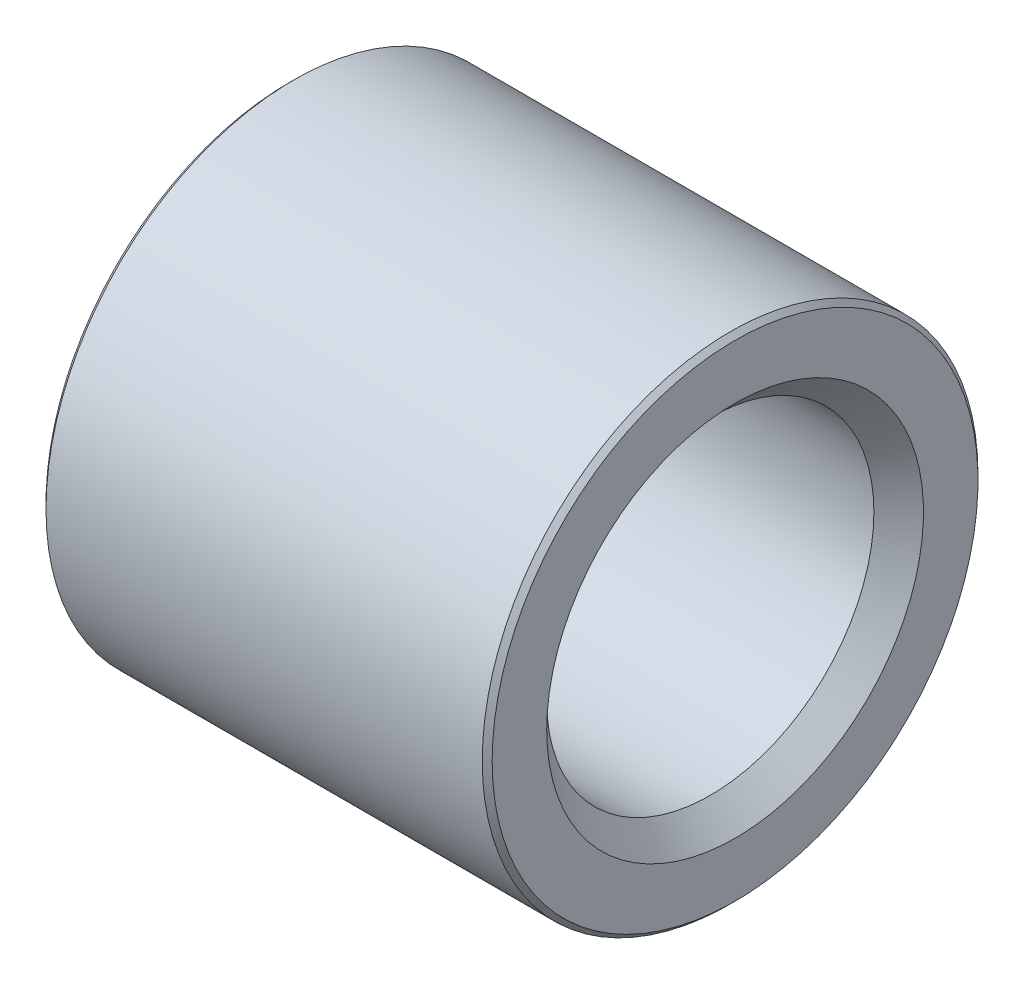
ISO-10303-21;
HEADER;
FILE_DESCRIPTION(('STEP AP214'),'2;1');
FILE_NAME('part.step','',(''),(''),'','','');
FILE_SCHEMA(('AUTOMOTIVE_DESIGN { 1 0 10303 214 1 1 1 1 }'));
ENDSEC;
DATA;
#1=APPLICATION_CONTEXT('core data for automotive mechanical design processes');
#2=APPLICATION_PROTOCOL_DEFINITION('international standard','automotive_design',2000,#1);
#3=PRODUCT_CONTEXT('',#1,'mechanical');
#4=PRODUCT('Part','Part','',(#3));
#5=PRODUCT_RELATED_PRODUCT_CATEGORY('part','',(#4));
#6=PRODUCT_DEFINITION_FORMATION('','',#4);
#7=PRODUCT_DEFINITION_CONTEXT('part definition',#1,'design');
#8=PRODUCT_DEFINITION('design','',#6,#7);
#9=PRODUCT_DEFINITION_SHAPE('','',#8);
#10=(LENGTH_UNIT() NAMED_UNIT(*) SI_UNIT(.MILLI.,.METRE.));
#11=(NAMED_UNIT(*) PLANE_ANGLE_UNIT() SI_UNIT($,.RADIAN.));
#12=(NAMED_UNIT(*) SI_UNIT($,.STERADIAN.) SOLID_ANGLE_UNIT());
#13=UNCERTAINTY_MEASURE_WITH_UNIT(LENGTH_MEASURE(1.E-05),#10,'distance_accuracy_value','');
#14=(GEOMETRIC_REPRESENTATION_CONTEXT(3) GLOBAL_UNCERTAINTY_ASSIGNED_CONTEXT((#13)) GLOBAL_UNIT_ASSIGNED_CONTEXT((#10,
#11,#12)) REPRESENTATION_CONTEXT('',''));
#15=CARTESIAN_POINT('',(0.,0.,0.));
#16=DIRECTION('',(0.,0.,1.));
#17=DIRECTION('',(1.,0.,0.));
#18=AXIS2_PLACEMENT_3D('',#15,#16,#17);
#19=CARTESIAN_POINT('',(45.,19.,0.));
#20=DIRECTION('',(-1.,0.,0.));
#21=DIRECTION('',(0.,0.,1.));
#22=AXIS2_PLACEMENT_3D('',#19,#20,#21);
#23=PLANE('',#22);
#24=CARTESIAN_POINT('',(45.,0.,0.));
#25=DIRECTION('',(-1.,0.,0.));
#26=DIRECTION('',(0.,0.,1.));
#27=AXIS2_PLACEMENT_3D('',#24,#25,#26);
#28=CIRCLE('',#27,24.5);
#29=CARTESIAN_POINT('',(45.,0.,24.5));
#30=VERTEX_POINT('',#29);
#31=EDGE_CURVE('E42',#30,#30,#28,.F.);
#32=ORIENTED_EDGE('',*,*,#31,.T.);
#33=EDGE_LOOP('',(#32));
#34=FACE_BOUND('',#33,.T.);
#35=CARTESIAN_POINT('',(45.,0.,0.));
#36=DIRECTION('',(-1.,0.,0.));
#37=DIRECTION('',(0.,0.,1.));
#38=AXIS2_PLACEMENT_3D('',#35,#36,#37);
#39=CIRCLE('',#38,19.);
#40=CARTESIAN_POINT('',(45.,0.,19.));
#41=VERTEX_POINT('',#40);
#42=EDGE_CURVE('E55',#41,#41,#39,.T.);
#43=ORIENTED_EDGE('',*,*,#42,.T.);
#44=EDGE_LOOP('',(#43));
#45=FACE_BOUND('',#44,.T.);
#46=ADVANCED_FACE('F35',(#34,#45),#23,.F.);
#47=CARTESIAN_POINT('',(42.5,0.,0.));
#48=DIRECTION('',(1.,0.,0.));
#49=DIRECTION('',(0.,0.,-1.));
#50=AXIS2_PLACEMENT_3D('',#47,#48,#49);
#51=CONICAL_SURFACE('',#50,16.5,0.785398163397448);
#52=ORIENTED_EDGE('',*,*,#42,.F.);
#53=EDGE_LOOP('',(#52));
#54=FACE_BOUND('',#53,.T.);
#55=CARTESIAN_POINT('',(42.5,0.,0.));
#56=DIRECTION('',(-1.,0.,0.));
#57=DIRECTION('',(0.,0.,1.));
#58=AXIS2_PLACEMENT_3D('',#55,#56,#57);
#59=CIRCLE('',#58,16.5);
#60=CARTESIAN_POINT('',(42.5,0.,16.5));
#61=VERTEX_POINT('',#60);
#62=EDGE_CURVE('E58',#61,#61,#59,.T.);
#63=ORIENTED_EDGE('',*,*,#62,.T.);
#64=EDGE_LOOP('',(#63));
#65=FACE_BOUND('',#64,.T.);
#66=ADVANCED_FACE('F85',(#54,#65),#51,.F.);
#67=CARTESIAN_POINT('',(0.,0.,0.));
#68=DIRECTION('',(-1.,0.,0.));
#69=DIRECTION('',(0.,0.,1.));
#70=AXIS2_PLACEMENT_3D('',#67,#68,#69);
#71=CYLINDRICAL_SURFACE('',#70,16.5);
#72=ORIENTED_EDGE('',*,*,#62,.F.);
#73=EDGE_LOOP('',(#72));
#74=FACE_BOUND('',#73,.T.);
#75=CARTESIAN_POINT('',(2.5,0.,0.));
#76=DIRECTION('',(-1.,0.,0.));
#77=DIRECTION('',(0.,0.,1.));
#78=AXIS2_PLACEMENT_3D('',#75,#76,#77);
#79=CIRCLE('',#78,16.5);
#80=CARTESIAN_POINT('',(2.5,0.,16.5));
#81=VERTEX_POINT('',#80);
#82=EDGE_CURVE('E61',#81,#81,#79,.T.);
#83=ORIENTED_EDGE('',*,*,#82,.T.);
#84=EDGE_LOOP('',(#83));
#85=FACE_BOUND('',#84,.T.);
#86=ADVANCED_FACE('F81',(#74,#85),#71,.F.);
#87=CARTESIAN_POINT('',(0.,0.,0.));
#88=DIRECTION('',(-1.,0.,0.));
#89=DIRECTION('',(0.,0.,1.));
#90=AXIS2_PLACEMENT_3D('',#87,#88,#89);
#91=CONICAL_SURFACE('',#90,19.,0.785398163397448);
#92=ORIENTED_EDGE('',*,*,#82,.F.);
#93=EDGE_LOOP('',(#92));
#94=FACE_BOUND('',#93,.T.);
#95=CARTESIAN_POINT('',(0.,0.,0.));
#96=DIRECTION('',(-1.,0.,0.));
#97=DIRECTION('',(0.,0.,1.));
#98=AXIS2_PLACEMENT_3D('',#95,#96,#97);
#99=CIRCLE('',#98,19.);
#100=CARTESIAN_POINT('',(0.,0.,19.));
#101=VERTEX_POINT('',#100);
#102=EDGE_CURVE('E64',#101,#101,#99,.T.);
#103=ORIENTED_EDGE('',*,*,#102,.T.);
#104=EDGE_LOOP('',(#103));
#105=FACE_BOUND('',#104,.T.);
#106=ADVANCED_FACE('F68',(#94,#105),#91,.F.);
#107=CARTESIAN_POINT('',(0.,19.,0.));
#108=DIRECTION('',(1.,0.,0.));
#109=DIRECTION('',(0.,0.,-1.));
#110=AXIS2_PLACEMENT_3D('',#107,#108,#109);
#111=PLANE('',#110);
#112=CARTESIAN_POINT('',(0.,0.,0.));
#113=DIRECTION('',(1.,0.,0.));
#114=DIRECTION('',(0.,0.,-1.));
#115=AXIS2_PLACEMENT_3D('',#112,#113,#114);
#116=CIRCLE('',#115,24.5);
#117=CARTESIAN_POINT('',(0.,0.,-24.5));
#118=VERTEX_POINT('',#117);
#119=EDGE_CURVE('E10',#118,#118,#116,.F.);
#120=ORIENTED_EDGE('',*,*,#119,.T.);
#121=EDGE_LOOP('',(#120));
#122=FACE_BOUND('',#121,.T.);
#123=ORIENTED_EDGE('',*,*,#102,.F.);
#124=EDGE_LOOP('',(#123));
#125=FACE_BOUND('',#124,.T.);
#126=ADVANCED_FACE('F70',(#122,#125),#111,.F.);
#127=CARTESIAN_POINT('',(0.,0.,0.));
#128=DIRECTION('',(-1.,0.,0.));
#129=DIRECTION('',(0.,0.,1.));
#130=AXIS2_PLACEMENT_3D('',#127,#128,#129);
#131=CYLINDRICAL_SURFACE('',#130,25.);
#132=CARTESIAN_POINT('',(44.5,0.,0.));
#133=DIRECTION('',(-1.,0.,0.));
#134=DIRECTION('',(0.,0.,1.));
#135=AXIS2_PLACEMENT_3D('',#132,#133,#134);
#136=CIRCLE('',#135,25.);
#137=CARTESIAN_POINT('',(44.5,0.,25.));
#138=VERTEX_POINT('',#137);
#139=EDGE_CURVE('E46',#138,#138,#136,.T.);
#140=ORIENTED_EDGE('',*,*,#139,.T.);
#141=EDGE_LOOP('',(#140));
#142=FACE_BOUND('',#141,.T.);
#143=CARTESIAN_POINT('',(0.499999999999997,0.,0.));
#144=DIRECTION('',(1.,0.,0.));
#145=DIRECTION('',(0.,0.,-1.));
#146=AXIS2_PLACEMENT_3D('',#143,#144,#145);
#147=CIRCLE('',#146,25.);
#148=CARTESIAN_POINT('',(0.499999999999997,0.,-25.));
#149=VERTEX_POINT('',#148);
#150=EDGE_CURVE('E50',#149,#149,#147,.T.);
#151=ORIENTED_EDGE('',*,*,#150,.T.);
#152=EDGE_LOOP('',(#151));
#153=FACE_BOUND('',#152,.T.);
#154=ADVANCED_FACE('F72',(#142,#153),#131,.T.);
#155=CARTESIAN_POINT('',(44.5,0.,0.));
#156=DIRECTION('',(-1.,0.,0.));
#157=DIRECTION('',(0.,0.,1.));
#158=AXIS2_PLACEMENT_3D('',#155,#156,#157);
#159=CONICAL_SURFACE('',#158,25.,0.785398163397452);
#160=ORIENTED_EDGE('',*,*,#31,.F.);
#161=EDGE_LOOP('',(#160));
#162=FACE_BOUND('',#161,.T.);
#163=ORIENTED_EDGE('',*,*,#139,.F.);
#164=EDGE_LOOP('',(#163));
#165=FACE_BOUND('',#164,.T.);
#166=ADVANCED_FACE('F78',(#162,#165),#159,.T.);
#167=CARTESIAN_POINT('',(0.,0.,0.));
#168=DIRECTION('',(1.,0.,0.));
#169=DIRECTION('',(0.,0.,-1.));
#170=AXIS2_PLACEMENT_3D('',#167,#168,#169);
#171=CONICAL_SURFACE('',#170,24.5,0.785398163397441);
#172=ORIENTED_EDGE('',*,*,#150,.F.);
#173=EDGE_LOOP('',(#172));
#174=FACE_BOUND('',#173,.T.);
#175=ORIENTED_EDGE('',*,*,#119,.F.);
#176=EDGE_LOOP('',(#175));
#177=FACE_BOUND('',#176,.T.);
#178=ADVANCED_FACE('F37',(#174,#177),#171,.T.);
#179=CLOSED_SHELL('',(#46,#66,#86,#106,#126,#154,#166,#178));
#180=MANIFOLD_SOLID_BREP('B2',#179);
#181=ADVANCED_BREP_SHAPE_REPRESENTATION('',(#18,#180),#14);
#182=SHAPE_DEFINITION_REPRESENTATION(#9,#181);
ENDSEC;
END-ISO-10303-21;
